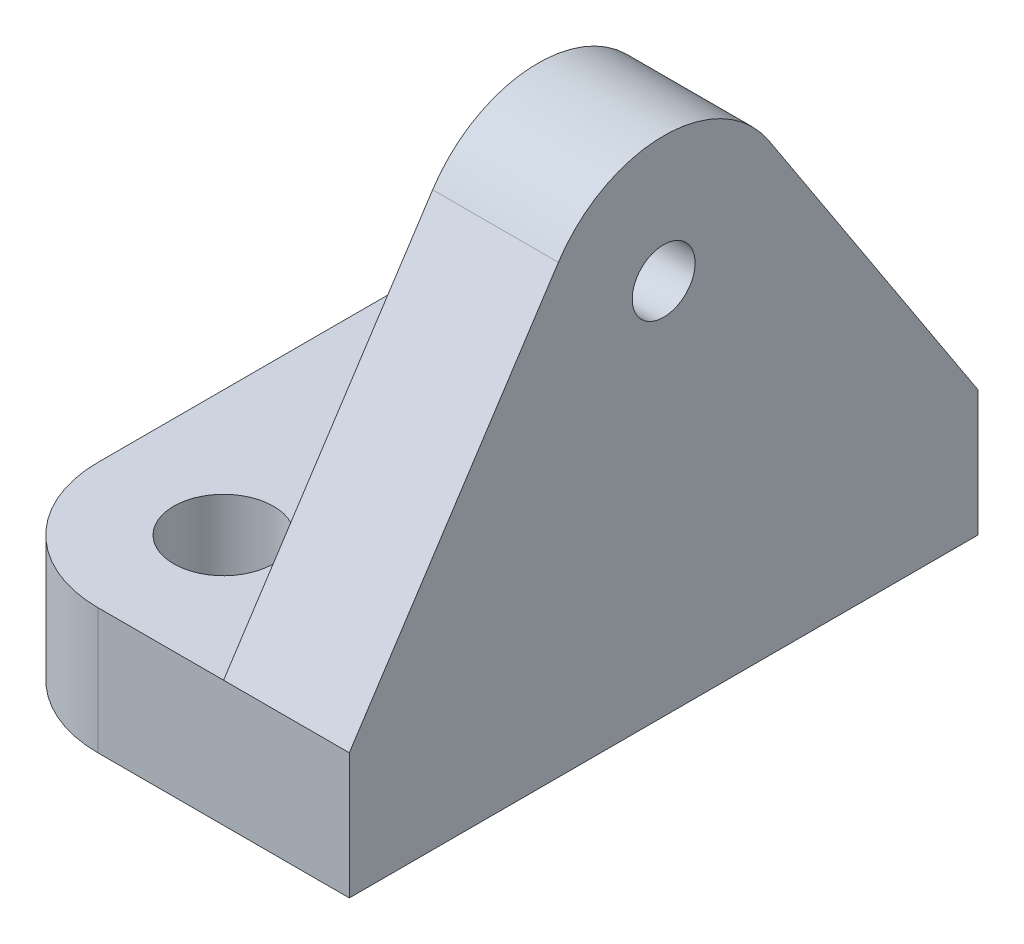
from build123d import *

# Parameters (mm, degrees)
EXTRUDE1_DEPTH          = 12.7
SKETCH3_R               = 3.175
EXTRUDE2_DEPTH          = 12.7
F_3_8_CLEARANCE_HOLE1_D = 10.0838


with BuildPart() as part:
    # Sketch1 → Extrude1 (new body)
    with BuildSketch(Plane(origin=(0, 0, 0), x_dir=(1, 0, 0), z_dir=(0, 1, 0))):
        with BuildLine():
            Line((12.7, 0), (38.1, 0))
            Line((38.1, 0), (38.1, 63.5))
            Line((38.1, 63.5), (12.7, 63.5))
            ThreePointArc((12.7, 63.5), (3.719743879, 59.780256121), (0, 50.8))
            Line((0, 50.8), (0, 12.7))
            ThreePointArc((0, 12.7), (3.719743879, 3.719743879), (12.7, 0))
        make_face()
    extrude(amount=-EXTRUDE1_DEPTH)

    # Sketch3 → Extrude2 (add)
    with BuildSketch(Plane(origin=(38.1, 0, 0), x_dir=(0, 0, -1), z_dir=(1, 0, 0))):
        with BuildLine():
            Line((0, 0), (21.115747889, 32.342815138))
            ThreePointArc((21.115747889, 32.342815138), (31.75, 38.1), (42.384252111, 32.342815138))
            Line((42.384252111, 32.342815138), (63.5, 0))
            Line((63.5, 0), (0, 0))
        make_face()
        with Locations((31.75, 25.4)):
            Circle(SKETCH3_R, mode=Mode.SUBTRACT)
    extrude(amount=-EXTRUDE2_DEPTH)

    # 3_8 Clearance Hole1 (through all)
    with Locations(Plane.XZ.offset(12.7)):
        with Locations((12.7, -50.8), (12.7, -12.7)):
            Hole(F_3_8_CLEARANCE_HOLE1_D / 2)


solid = part.part
